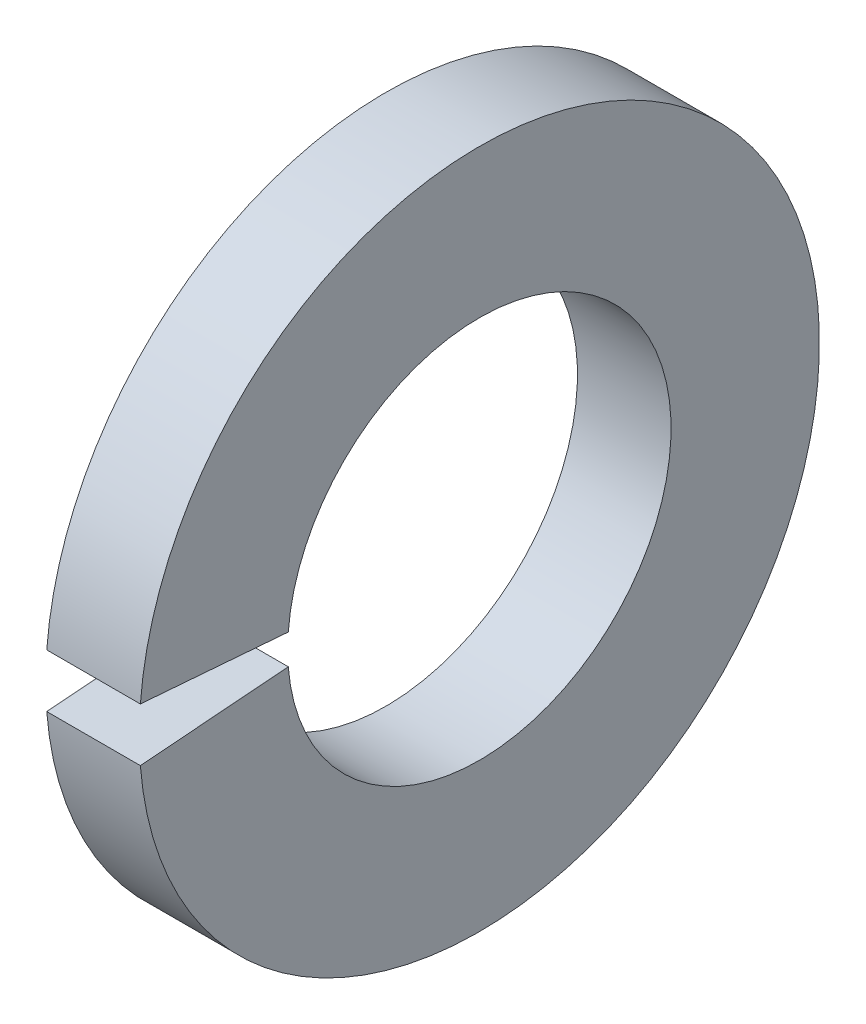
from build123d import *

# Parameters (mm, degrees)
SKETCH1_W = 2.3876
SKETCH1_H = 3.7846
GAP_DEPTH = 13.497225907


with BuildPart() as part:
    # Sketch1 → Base-Revolve (revolve)
    with BuildSketch(Plane.XY, mode=Mode.PRIVATE) as base_revolve_sk:
        with Locations((-1.1938, 6.7818)):
            Rectangle(SKETCH1_W, SKETCH1_H)
    revolve(base_revolve_sk.sketch.rotate(Axis((-34.925, 0, 0), (1, 0, 0)), 90), axis=Axis((-34.925, 0, 0), (1, 0, 0)))

    # Sketch2 → Gap (cut, through all)
    with BuildSketch(Plane(origin=(0, 0, 0), x_dir=(0, -1, 0), z_dir=(-1, 0, 0))):
        with BuildLine():
            Line((0, 0), (0.694173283, 8.820307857))
            ThreePointArc((0.694173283, 8.820307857), (0, 8.847582), (-0.694173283, 8.820307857))
            Line((-0.694173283, 8.820307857), (0, 0))
        make_face()
    extrude(amount=GAP_DEPTH, mode=Mode.SUBTRACT)


solid = part.part
